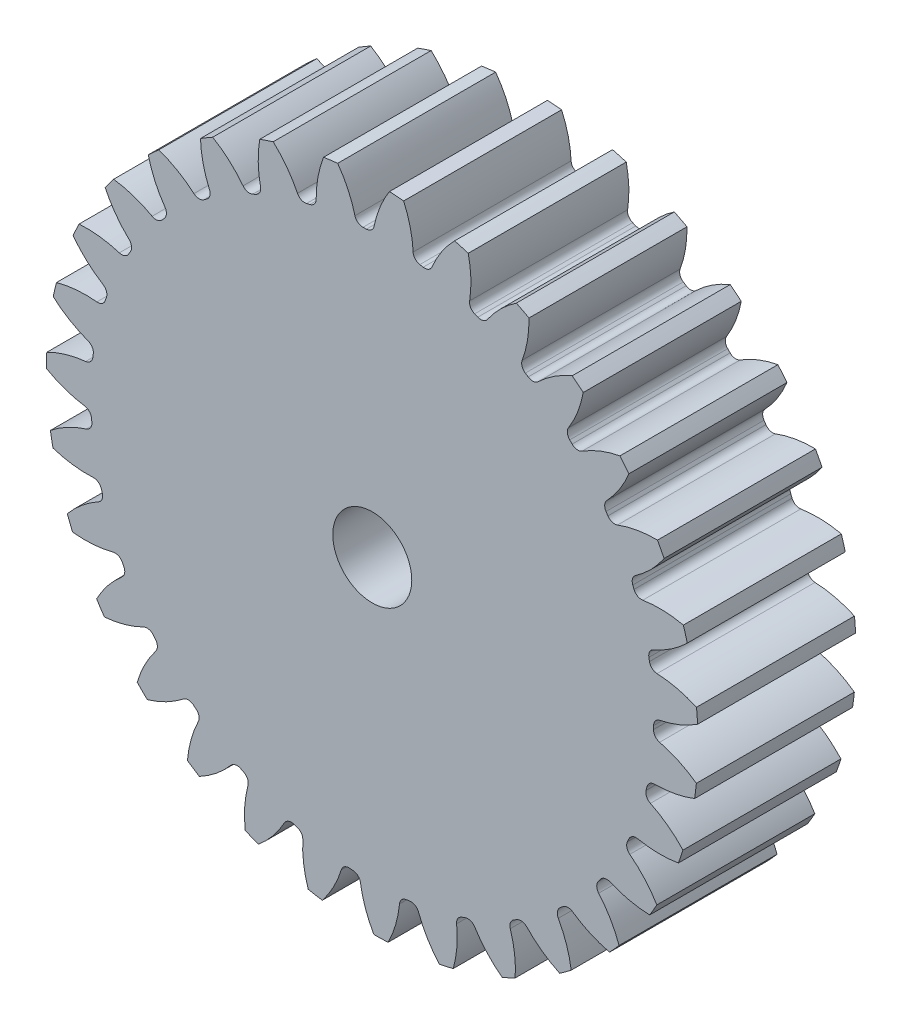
from build123d import *

# Parameters (mm, degrees)
SKETCH3_R         = 209.55
GEARBODY_DEPTH    = 101.6
TOOTHCUT_DEPTH    = 314.280968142
CIRPATTERN1_COUNT = 31
BOREDIA_R         = 25.4
BORE_DEPTH        = 12700


with BuildPart() as part:
    # Sketch3 → gearBody (new body)
    with BuildSketch(Plane.XY):
        Circle(SKETCH3_R)
    extrude(amount=GEARBODY_DEPTH)

    # Sketch2 → toothCut (cut, through all)
    with BuildSketch(Plane.XY):
        with BuildLine():
            ThreePointArc((180.893772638, -5.42159072), (180.923509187, -4.316763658), (180.946497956, -3.211775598))
            ThreePointArc((180.946497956, -3.211775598), (182.137952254, -0.00139879), (185.074714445, 1.759711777))
            ThreePointArc((185.074714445, 1.759711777), (197.791271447, 5.652500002), (209.55, 11.865142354))
            ThreePointArc((209.55, 11.865142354), (209.825928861, -5.006364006), (208.745677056, -21.845512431))
            ThreePointArc((208.745677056, -21.845512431), (197.296622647, -15.079141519), (184.780191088, -10.584304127))
            ThreePointArc((184.780191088, -10.584304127), (181.930761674, -8.685137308), (180.893772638, -5.42159072))
        make_face()
    toothcut = extrude(amount=TOOTHCUT_DEPTH, mode=Mode.SUBTRACT)

    # CirPattern1: toothCut ×31 about axis
    cirpattern1_axis = Axis((0, 0, 0), (0, 0, 1))
    for i in range(1, CIRPATTERN1_COUNT):
        add(toothcut.rotate(cirpattern1_axis, i * 360 / CIRPATTERN1_COUNT), mode=Mode.SUBTRACT)

    # boreDia → bore (cut, symmetric)
    with BuildSketch(Plane.XY):
        Circle(BOREDIA_R)
    extrude(amount=BORE_DEPTH, both=True, mode=Mode.SUBTRACT)


solid = part.part
